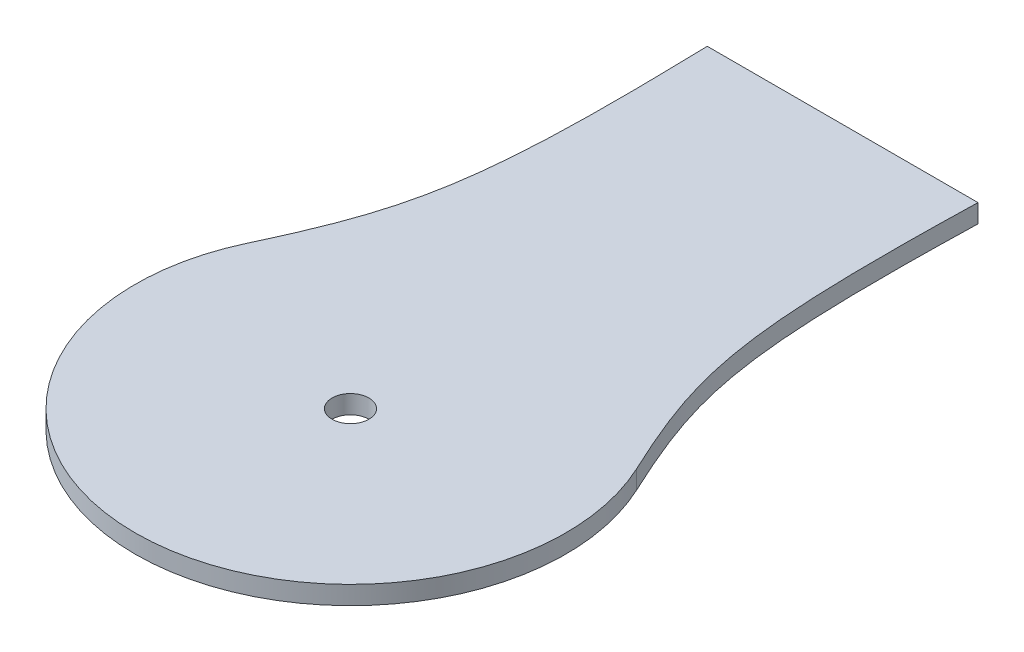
ISO-10303-21;
HEADER;
FILE_DESCRIPTION(('STEP AP214'),'2;1');
FILE_NAME('part.step','',(''),(''),'','','');
FILE_SCHEMA(('AUTOMOTIVE_DESIGN { 1 0 10303 214 1 1 1 1 }'));
ENDSEC;
DATA;
#1=APPLICATION_CONTEXT('core data for automotive mechanical design processes');
#2=APPLICATION_PROTOCOL_DEFINITION('international standard','automotive_design',2000,#1);
#3=PRODUCT_CONTEXT('',#1,'mechanical');
#4=PRODUCT('Part','Part','',(#3));
#5=PRODUCT_RELATED_PRODUCT_CATEGORY('part','',(#4));
#6=PRODUCT_DEFINITION_FORMATION('','',#4);
#7=PRODUCT_DEFINITION_CONTEXT('part definition',#1,'design');
#8=PRODUCT_DEFINITION('design','',#6,#7);
#9=PRODUCT_DEFINITION_SHAPE('','',#8);
#10=(LENGTH_UNIT() NAMED_UNIT(*) SI_UNIT(.MILLI.,.METRE.));
#11=(NAMED_UNIT(*) PLANE_ANGLE_UNIT() SI_UNIT($,.RADIAN.));
#12=(NAMED_UNIT(*) SI_UNIT($,.STERADIAN.) SOLID_ANGLE_UNIT());
#13=UNCERTAINTY_MEASURE_WITH_UNIT(LENGTH_MEASURE(1.E-05),#10,'distance_accuracy_value','');
#14=(GEOMETRIC_REPRESENTATION_CONTEXT(3) GLOBAL_UNCERTAINTY_ASSIGNED_CONTEXT((#13)) GLOBAL_UNIT_ASSIGNED_CONTEXT((#10,
#11,#12)) REPRESENTATION_CONTEXT('',''));
#15=CARTESIAN_POINT('',(0.,0.,0.));
#16=DIRECTION('',(0.,0.,1.));
#17=DIRECTION('',(1.,0.,0.));
#18=AXIS2_PLACEMENT_3D('',#15,#16,#17);
#19=CARTESIAN_POINT('',(-11.6421030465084,1.5,19.9672022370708));
#20=DIRECTION('',(0.,-1.,0.));
#21=DIRECTION('',(0.,0.,-1.));
#22=AXIS2_PLACEMENT_3D('',#19,#20,#21);
#23=PLANE('',#22);
#24=CARTESIAN_POINT('',(-11.,1.5,0.));
#25=CARTESIAN_POINT('',(-10.5072755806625,1.5,18.9209401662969));
#26=CARTESIAN_POINT('',(-11.5871001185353,1.5,23.4616482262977));
#27=CARTESIAN_POINT('',(-15.853697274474,1.5,32.5898527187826));
#28=B_SPLINE_CURVE_WITH_KNOTS('',3,(#24,#25,#26,#27),.UNSPECIFIED.,.F.,.F.,(4,4),(0.,1.),.UNSPECIFIED.);
#29=CARTESIAN_POINT('',(-11.,1.5,0.));
#30=VERTEX_POINT('',#29);
#31=CARTESIAN_POINT('',(-15.853697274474,1.5,32.5898527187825));
#32=VERTEX_POINT('',#31);
#33=EDGE_CURVE('E85',#30,#32,#28,.T.);
#34=ORIENTED_EDGE('',*,*,#33,.T.);
#35=CARTESIAN_POINT('',(0.,1.5,40.));
#36=DIRECTION('',(0.,1.,0.));
#37=DIRECTION('',(0.,0.,1.));
#38=AXIS2_PLACEMENT_3D('',#35,#36,#37);
#39=CIRCLE('',#38,17.5);
#40=CARTESIAN_POINT('',(15.8536972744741,1.5,32.5898527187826));
#41=VERTEX_POINT('',#40);
#42=EDGE_CURVE('E80',#32,#41,#39,.T.);
#43=ORIENTED_EDGE('',*,*,#42,.T.);
#44=CARTESIAN_POINT('',(15.8536972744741,1.5,32.5898527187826));
#45=CARTESIAN_POINT('',(11.5871001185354,1.5,23.4616482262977));
#46=CARTESIAN_POINT('',(10.5072755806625,1.5,18.9209401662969));
#47=CARTESIAN_POINT('',(11.,1.5,0.));
#48=B_SPLINE_CURVE_WITH_KNOTS('',3,(#44,#45,#46,#47),.UNSPECIFIED.,.F.,.F.,(4,4),(0.,1.),.UNSPECIFIED.);
#49=CARTESIAN_POINT('',(11.,1.5,0.));
#50=VERTEX_POINT('',#49);
#51=EDGE_CURVE('E83',#41,#50,#48,.T.);
#52=ORIENTED_EDGE('',*,*,#51,.T.);
#53=DIRECTION('',(-1.,0.,0.));
#54=VECTOR('',#53,1.);
#55=CARTESIAN_POINT('',(-11.,1.5,0.));
#56=LINE('',#55,#54);
#57=EDGE_CURVE('E50',#50,#30,#56,.T.);
#58=ORIENTED_EDGE('',*,*,#57,.T.);
#59=EDGE_LOOP('',(#34,#43,#52,#58));
#60=FACE_BOUND('',#59,.T.);
#61=CARTESIAN_POINT('',(0.,1.5,40.));
#62=DIRECTION('',(0.,1.,0.));
#63=DIRECTION('',(0.,0.,1.));
#64=AXIS2_PLACEMENT_3D('',#61,#62,#63);
#65=CIRCLE('',#64,1.5);
#66=CARTESIAN_POINT('',(0.,1.5,41.5));
#67=VERTEX_POINT('',#66);
#68=EDGE_CURVE('E129',#67,#67,#65,.T.);
#69=ORIENTED_EDGE('',*,*,#68,.F.);
#70=EDGE_LOOP('',(#69));
#71=FACE_BOUND('',#70,.T.);
#72=ADVANCED_FACE('F32',(#60,#71),#23,.F.);
#73=CARTESIAN_POINT('',(-11.6421030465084,0.,19.9672022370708));
#74=DIRECTION('',(0.,-1.,0.));
#75=DIRECTION('',(0.,0.,-1.));
#76=AXIS2_PLACEMENT_3D('',#73,#74,#75);
#77=PLANE('',#76);
#78=CARTESIAN_POINT('',(-11.,0.,0.));
#79=CARTESIAN_POINT('',(-10.5072755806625,0.,18.9209401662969));
#80=CARTESIAN_POINT('',(-11.5871001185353,0.,23.4616482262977));
#81=CARTESIAN_POINT('',(-15.853697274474,0.,32.5898527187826));
#82=B_SPLINE_CURVE_WITH_KNOTS('',3,(#78,#79,#80,#81),.UNSPECIFIED.,.F.,.F.,(4,4),(0.,1.),.UNSPECIFIED.);
#83=CARTESIAN_POINT('',(-11.,0.,0.));
#84=VERTEX_POINT('',#83);
#85=CARTESIAN_POINT('',(-15.853697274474,0.,32.5898527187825));
#86=VERTEX_POINT('',#85);
#87=EDGE_CURVE('E135',#84,#86,#82,.T.);
#88=ORIENTED_EDGE('',*,*,#87,.F.);
#89=DIRECTION('',(-1.,0.,0.));
#90=VECTOR('',#89,1.);
#91=CARTESIAN_POINT('',(-11.,0.,0.));
#92=LINE('',#91,#90);
#93=CARTESIAN_POINT('',(11.,0.,0.));
#94=VERTEX_POINT('',#93);
#95=EDGE_CURVE('E73',#94,#84,#92,.T.);
#96=ORIENTED_EDGE('',*,*,#95,.F.);
#97=CARTESIAN_POINT('',(15.8536972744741,0.,32.5898527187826));
#98=CARTESIAN_POINT('',(11.5871001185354,0.,23.4616482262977));
#99=CARTESIAN_POINT('',(10.5072755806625,0.,18.9209401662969));
#100=CARTESIAN_POINT('',(11.,0.,0.));
#101=B_SPLINE_CURVE_WITH_KNOTS('',3,(#97,#98,#99,#100),.UNSPECIFIED.,.F.,.F.,(4,4),(0.,1.),.UNSPECIFIED.);
#102=CARTESIAN_POINT('',(15.8536972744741,0.,32.5898527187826));
#103=VERTEX_POINT('',#102);
#104=EDGE_CURVE('E67',#103,#94,#101,.T.);
#105=ORIENTED_EDGE('',*,*,#104,.F.);
#106=CARTESIAN_POINT('',(0.,0.,40.));
#107=DIRECTION('',(0.,1.,0.));
#108=DIRECTION('',(0.,0.,1.));
#109=AXIS2_PLACEMENT_3D('',#106,#107,#108);
#110=CIRCLE('',#109,17.5);
#111=EDGE_CURVE('E89',#86,#103,#110,.T.);
#112=ORIENTED_EDGE('',*,*,#111,.F.);
#113=EDGE_LOOP('',(#88,#96,#105,#112));
#114=FACE_BOUND('',#113,.T.);
#115=CARTESIAN_POINT('',(0.,0.,40.));
#116=DIRECTION('',(0.,1.,0.));
#117=DIRECTION('',(0.,0.,1.));
#118=AXIS2_PLACEMENT_3D('',#115,#116,#117);
#119=CIRCLE('',#118,1.5);
#120=CARTESIAN_POINT('',(0.,0.,41.5));
#121=VERTEX_POINT('',#120);
#122=EDGE_CURVE('E132',#121,#121,#119,.T.);
#123=ORIENTED_EDGE('',*,*,#122,.T.);
#124=EDGE_LOOP('',(#123));
#125=FACE_BOUND('',#124,.T.);
#126=ADVANCED_FACE('F111',(#114,#125),#77,.T.);
#127=DIRECTION('',(0.,-1.,0.));
#128=VECTOR('',#127,1.);
#129=SURFACE_OF_LINEAR_EXTRUSION('',#28,#128);
#130=ORIENTED_EDGE('',*,*,#87,.T.);
#131=DIRECTION('',(0.,-1.,0.));
#132=VECTOR('',#131,1.);
#133=CARTESIAN_POINT('',(-15.853697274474,1.5,32.5898527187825));
#134=LINE('',#133,#132);
#135=EDGE_CURVE('E11',#32,#86,#134,.T.);
#136=ORIENTED_EDGE('',*,*,#135,.F.);
#137=ORIENTED_EDGE('',*,*,#33,.F.);
#138=DIRECTION('',(0.,-1.,0.));
#139=VECTOR('',#138,1.);
#140=CARTESIAN_POINT('',(-11.,1.5,0.));
#141=LINE('',#140,#139);
#142=EDGE_CURVE('E93',#30,#84,#141,.T.);
#143=ORIENTED_EDGE('',*,*,#142,.T.);
#144=EDGE_LOOP('',(#130,#136,#137,#143));
#145=FACE_BOUND('',#144,.T.);
#146=ADVANCED_FACE('F34',(#145),#129,.F.);
#147=CARTESIAN_POINT('',(0.,1.5,40.));
#148=DIRECTION('',(0.,-1.,0.));
#149=DIRECTION('',(0.,0.,-1.));
#150=AXIS2_PLACEMENT_3D('',#147,#148,#149);
#151=CYLINDRICAL_SURFACE('',#150,17.5);
#152=ORIENTED_EDGE('',*,*,#111,.T.);
#153=DIRECTION('',(0.,-1.,0.));
#154=VECTOR('',#153,1.);
#155=CARTESIAN_POINT('',(15.8536972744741,1.5,32.5898527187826));
#156=LINE('',#155,#154);
#157=EDGE_CURVE('E42',#41,#103,#156,.T.);
#158=ORIENTED_EDGE('',*,*,#157,.F.);
#159=ORIENTED_EDGE('',*,*,#42,.F.);
#160=ORIENTED_EDGE('',*,*,#135,.T.);
#161=EDGE_LOOP('',(#152,#158,#159,#160));
#162=FACE_BOUND('',#161,.T.);
#163=ADVANCED_FACE('F88',(#162),#151,.T.);
#164=DIRECTION('',(0.,-1.,0.));
#165=VECTOR('',#164,1.);
#166=SURFACE_OF_LINEAR_EXTRUSION('',#48,#165);
#167=ORIENTED_EDGE('',*,*,#104,.T.);
#168=DIRECTION('',(0.,-1.,0.));
#169=VECTOR('',#168,1.);
#170=CARTESIAN_POINT('',(11.,1.5,0.));
#171=LINE('',#170,#169);
#172=EDGE_CURVE('E90',#50,#94,#171,.T.);
#173=ORIENTED_EDGE('',*,*,#172,.F.);
#174=ORIENTED_EDGE('',*,*,#51,.F.);
#175=ORIENTED_EDGE('',*,*,#157,.T.);
#176=EDGE_LOOP('',(#167,#173,#174,#175));
#177=FACE_BOUND('',#176,.T.);
#178=ADVANCED_FACE('F91',(#177),#166,.F.);
#179=CARTESIAN_POINT('',(-11.,1.5,0.));
#180=DIRECTION('',(0.,0.,1.));
#181=DIRECTION('',(1.,0.,0.));
#182=AXIS2_PLACEMENT_3D('',#179,#180,#181);
#183=PLANE('',#182);
#184=ORIENTED_EDGE('',*,*,#95,.T.);
#185=ORIENTED_EDGE('',*,*,#142,.F.);
#186=ORIENTED_EDGE('',*,*,#57,.F.);
#187=ORIENTED_EDGE('',*,*,#172,.T.);
#188=EDGE_LOOP('',(#184,#185,#186,#187));
#189=FACE_BOUND('',#188,.T.);
#190=ADVANCED_FACE('F105',(#189),#183,.F.);
#191=CARTESIAN_POINT('',(0.,1.5,40.));
#192=DIRECTION('',(0.,-1.,0.));
#193=DIRECTION('',(0.,0.,-1.));
#194=AXIS2_PLACEMENT_3D('',#191,#192,#193);
#195=CYLINDRICAL_SURFACE('',#194,1.5);
#196=ORIENTED_EDGE('',*,*,#68,.T.);
#197=EDGE_LOOP('',(#196));
#198=FACE_BOUND('',#197,.T.);
#199=ORIENTED_EDGE('',*,*,#122,.F.);
#200=EDGE_LOOP('',(#199));
#201=FACE_BOUND('',#200,.T.);
#202=ADVANCED_FACE('F120',(#198,#201),#195,.F.);
#203=CLOSED_SHELL('',(#72,#126,#146,#163,#178,#190,#202));
#204=MANIFOLD_SOLID_BREP('B2',#203);
#205=ADVANCED_BREP_SHAPE_REPRESENTATION('',(#18,#204),#14);
#206=SHAPE_DEFINITION_REPRESENTATION(#9,#205);
ENDSEC;
END-ISO-10303-21;
